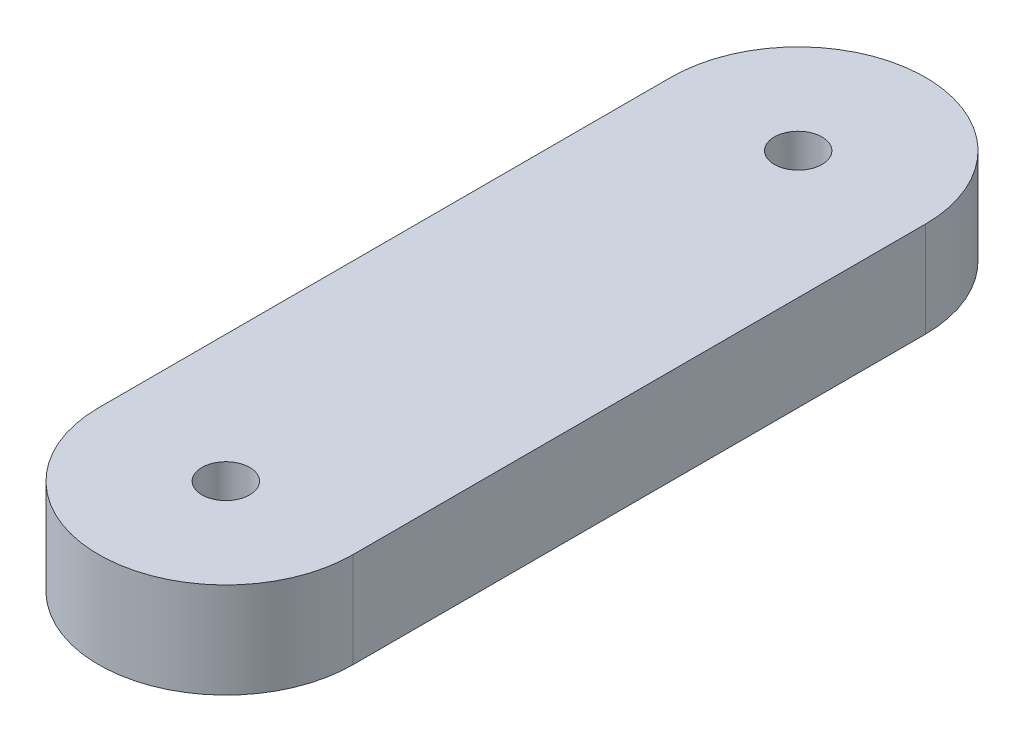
from build123d import *

# Parameters (mm, degrees)
SKETCH_1_R      = 1.5
EXTRUDE_1_DEPTH = 6


with BuildPart() as part:
    # Sketch 1 → Extrude 1 (new body)
    with BuildSketch(Plane.XZ):
        with BuildLine():
            Line((8, -18), (8, 18))
            ThreePointArc((8, 18), (0, 26), (-8, 18))
            Line((-8, 18), (-8, -18))
            ThreePointArc((-8, -18), (0, -26), (8, -18))
        make_face()
        with Locations(Location((0, -18, 0), (0, 0, 90))):
            Circle(SKETCH_1_R, mode=Mode.SUBTRACT)
        with Locations(Location((0, 18, 0), (0, 0, 90))):
            Circle(SKETCH_1_R, mode=Mode.SUBTRACT)
    extrude(amount=-EXTRUDE_1_DEPTH)


solid = part.part
